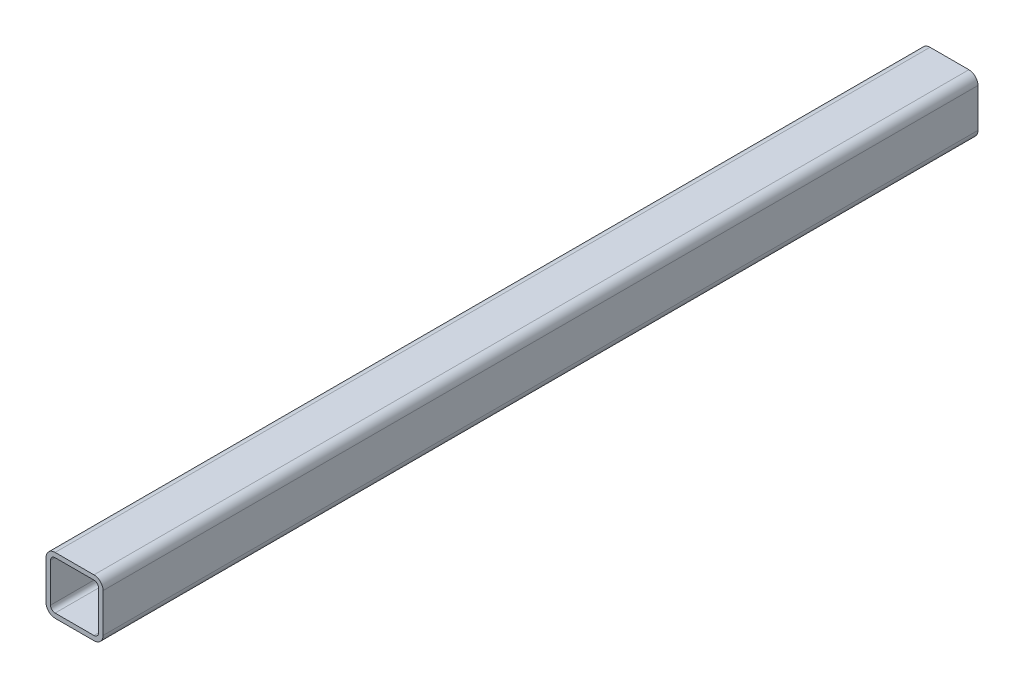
from build123d import *

# Parameters (mm, degrees)
EXTRUDE_THIN1_DEPTH = 292.1


with BuildPart() as part:
    # Sketch1 → Extrude-Thin1 (new, symmetric)
    with BuildSketch(Plane.XY):
        with BuildLine():
            Line((-19.05, -12.97432), (-19.05, 12.97432))
            ThreePointArc((-19.05, 12.97432), (-17.270474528, 17.270474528), (-12.97432, 19.05))
            Line((-12.97432, 19.05), (12.97432, 19.05))
            ThreePointArc((12.97432, 19.05), (17.270474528, 17.270474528), (19.05, 12.97432))
            Line((19.05, 12.97432), (19.05, -12.97432))
            ThreePointArc((19.05, -12.97432), (17.270474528, -17.270474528), (12.97432, -19.05))
            Line((12.97432, -19.05), (-12.97432, -19.05))
            ThreePointArc((-12.97432, -19.05), (-17.270474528, -17.270474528), (-19.05, -12.97432))
        make_face()
        with BuildLine():
            Line((-16.01216, -12.97432), (-16.01216, 12.97432))
            ThreePointArc((-16.01216, 12.97432), (-15.122397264, 15.122397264), (-12.97432, 16.01216))
            Line((-12.97432, 16.01216), (12.97432, 16.01216))
            ThreePointArc((12.97432, 16.01216), (15.122397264, 15.122397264), (16.01216, 12.97432))
            Line((16.01216, 12.97432), (16.01216, -12.97432))
            ThreePointArc((16.01216, -12.97432), (15.122397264, -15.122397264), (12.97432, -16.01216))
            Line((12.97432, -16.01216), (-12.97432, -16.01216))
            ThreePointArc((-12.97432, -16.01216), (-15.122397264, -15.122397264), (-16.01216, -12.97432))
        make_face(mode=Mode.SUBTRACT)
    extrude(amount=EXTRUDE_THIN1_DEPTH, both=True)


solid = part.part
